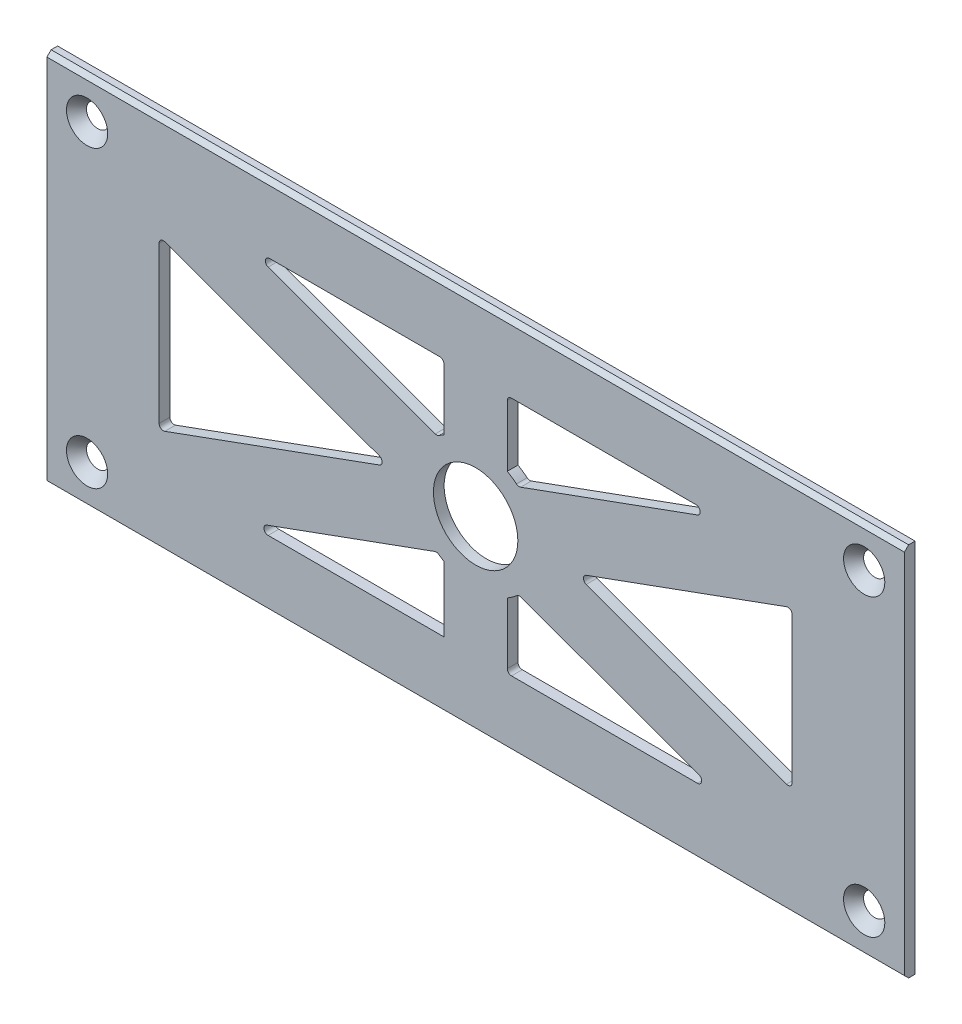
from build123d import *

# Parameters (mm, degrees)
SKETCH2_W                                    = 203.2
SKETCH2_H                                    = 88.9
SKETCH2_R                                    = 10
BOSS_EXTRUDE1_DEPTH                          = 1.27
SKETCH3_R                                    = 2.5527
CUT_EXTRUDE1_DEPTH                           = 111.92706658
CSK_FOR_10_OVAL_HEAD_MACHINE_SCREW1_AT_COUNT = 2
CSK_FOR_10_OVAL_HEAD_MACHINE_SCREW1_AT_PITCH = 69.85
CSK_FOR_10_OVAL_HEAD_MACHINE_SCREW1_2_COUNT  = 2
CSK_FOR_10_OVAL_HEAD_MACHINE_SCREW1_2_PITCH  = 196.952392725
CSK_FOR_10_OVAL_HEAD_MACHINE_SCREW1_3_COUNT  = 2
CSK_FOR_10_OVAL_HEAD_MACHINE_SCREW1_3_PITCH  = 184.15
CUT_EXTRUDE2_DEPTH                           = 10
FILLET1_R                                    = 1
CHAMFER1_SIZE                                = 1


with BuildPart() as part:
    # Sketch2 → Boss-Extrude1 (new, symmetric)
    with BuildSketch(Plane.XY):
        Rectangle(SKETCH2_W, SKETCH2_H)
        Circle(SKETCH2_R, mode=Mode.SUBTRACT)
    extrude(amount=BOSS_EXTRUDE1_DEPTH, both=True)

    # Sketch3 → Cut-Extrude1 (cut, through all)
    with BuildSketch(Plane.XY.offset(1.27)):
        with Locations((-92.075, 34.925)):
            Circle(SKETCH3_R)
        with Locations((-92.075, -34.925)):
            Circle(SKETCH3_R)
        with Locations((92.075, -34.925)):
            Circle(SKETCH3_R)
        with Locations((92.075, 34.925)):
            Circle(SKETCH3_R)
    extrude(amount=-CUT_EXTRUDE1_DEPTH, mode=Mode.SUBTRACT)

    # Sketch6 → CSK for _10 Oval Head Machine Screw1 (revolve, cut)
    with BuildSketch(Plane(origin=(-92.075, 34.925, 1.27), x_dir=(0, -1, 0), z_dir=(1, 0, 0))):
        Polygon((0, 0), (0, 2.54), (2.5527, 2.54), (2.5527, 2.688180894), (4.8895, 0), align=None)
    csk_for_10_oval_head_machine_screw1 = revolve(axis=Axis((-92.075, 34.925, 7.62), (0, 0, -1)), mode=Mode.SUBTRACT)

    # CSK for _10 Oval Head Machine Screw1 at: CSK for _10 Oval Head Machine Screw1 ×2
    with Locations(*[(0, -i * CSK_FOR_10_OVAL_HEAD_MACHINE_SCREW1_AT_PITCH, 0) for i in range(1, CSK_FOR_10_OVAL_HEAD_MACHINE_SCREW1_AT_COUNT)]):
        add(csk_for_10_oval_head_machine_screw1, mode=Mode.SUBTRACT)

    # CSK for _10 Oval Head Machine Screw1 2: CSK for _10 Oval Head Machine Screw1 ×2
    with Locations(*[Vector(0.9349975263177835, -0.35465423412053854, 0) * (i * CSK_FOR_10_OVAL_HEAD_MACHINE_SCREW1_2_PITCH) for i in range(1, CSK_FOR_10_OVAL_HEAD_MACHINE_SCREW1_2_COUNT)]):
        add(csk_for_10_oval_head_machine_screw1, mode=Mode.SUBTRACT)

    # CSK for _10 Oval Head Machine Screw1 3: CSK for _10 Oval Head Machine Screw1 ×2
    with Locations(*[(i * CSK_FOR_10_OVAL_HEAD_MACHINE_SCREW1_3_PITCH, 0, 0) for i in range(1, CSK_FOR_10_OVAL_HEAD_MACHINE_SCREW1_3_COUNT)]):
        add(csk_for_10_oval_head_machine_screw1, mode=Mode.SUBTRACT)

    # Sketch8 → Cut-Extrude2 (cut)
    with BuildSketch(Plane.XY.offset(1.27)):
        with BuildLine():
            ThreePointArc((-7.5, -12.990381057), (-8.352596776, -12.459298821), (-9.167737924, -11.872345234))
            Line((-9.167737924, -11.872345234), (-54.851843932, -28.5))
            Line((-54.851843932, -28.5), (-7.5, -28.5))
            Line((-7.5, -28.5), (-7.5, -20.745190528))
            Line((-7.5, -20.745190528), (-7.5, -12.990381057))
        make_face()
        with BuildLine():
            Line((58.24084358, -28.5), (10.187304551, -11.009942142))
            ThreePointArc((10.187304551, -11.009942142), (8.898916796, -12.075151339), (7.5, -12.990381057))
            Line((7.5, -12.990381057), (7.5, -20.745190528))
            Line((7.5, -20.745190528), (7.5, -28.5))
            Line((7.5, -28.5), (58.24084358, -28.5))
        make_face()
        Polygon((75, 18.762206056), (23.623032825, 0.062519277), (75, -18.637167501), align=None)
        with BuildLine():
            Line((7.5, 28.5), (7.5, 12.990381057))
            ThreePointArc((7.5, 12.990381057), (8.845524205, 12.114318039), (10.089701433, 11.099456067))
            Line((10.089701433, 11.099456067), (57.897302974, 28.5))
            Line((57.897302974, 28.5), (7.5, 28.5))
        make_face()
        with BuildLine():
            ThreePointArc((-9.056963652, 11.957065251), (-8.2945884, 12.49799197), (-7.5, 12.990381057))
            Line((-7.5, 12.990381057), (-7.5, 28.5))
            Line((-7.5, 28.5), (-54.508303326, 28.5))
            Line((-54.508303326, 28.5), (-9.056963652, 11.957065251))
        make_face()
        Polygon((-75, -19.870662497), (-20.234033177, 0.062519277), (-75, 19.995701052), align=None)
    extrude(amount=-CUT_EXTRUDE2_DEPTH, mode=Mode.SUBTRACT)

    # Fillet1
    fillet1_edges = [part.edges().sort_by_distance(p)[0] for p in [
        (10.187304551, -11.009942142, 0),
        (58.24084358, -28.5, 0),
        (7.5, -28.5, 0),
        (23.623032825, 0.062519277, 0),
        (75, 18.762206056, 0),
        (75, -18.637167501, 0),
        (-20.234033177, 0.062519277, 0),
        (-75, -19.870662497, 0),
        (-75, 19.995701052, 0),
        (-9.167737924, -11.872345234, 0),
        (-54.851843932, -28.5, 0),
        (-9.056963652, 11.957065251, 0),
        (-54.508303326, 28.5, 0),
        (-7.5, 28.5, 0),
        (10.089701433, 11.099456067, 0),
        (7.5, 28.5, 0),
        (57.897302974, 28.5, 0),
    ]]
    fillet(fillet1_edges, radius=FILLET1_R)

    # Chamfer1
    chamfer1_edges = [part.edges().sort_by_distance(p)[0] for p in [
        (0, -44.45, 1.27),
        (0, 44.45, 1.27),
    ]]
    chamfer(chamfer1_edges, length=CHAMFER1_SIZE)


solid = part.part
